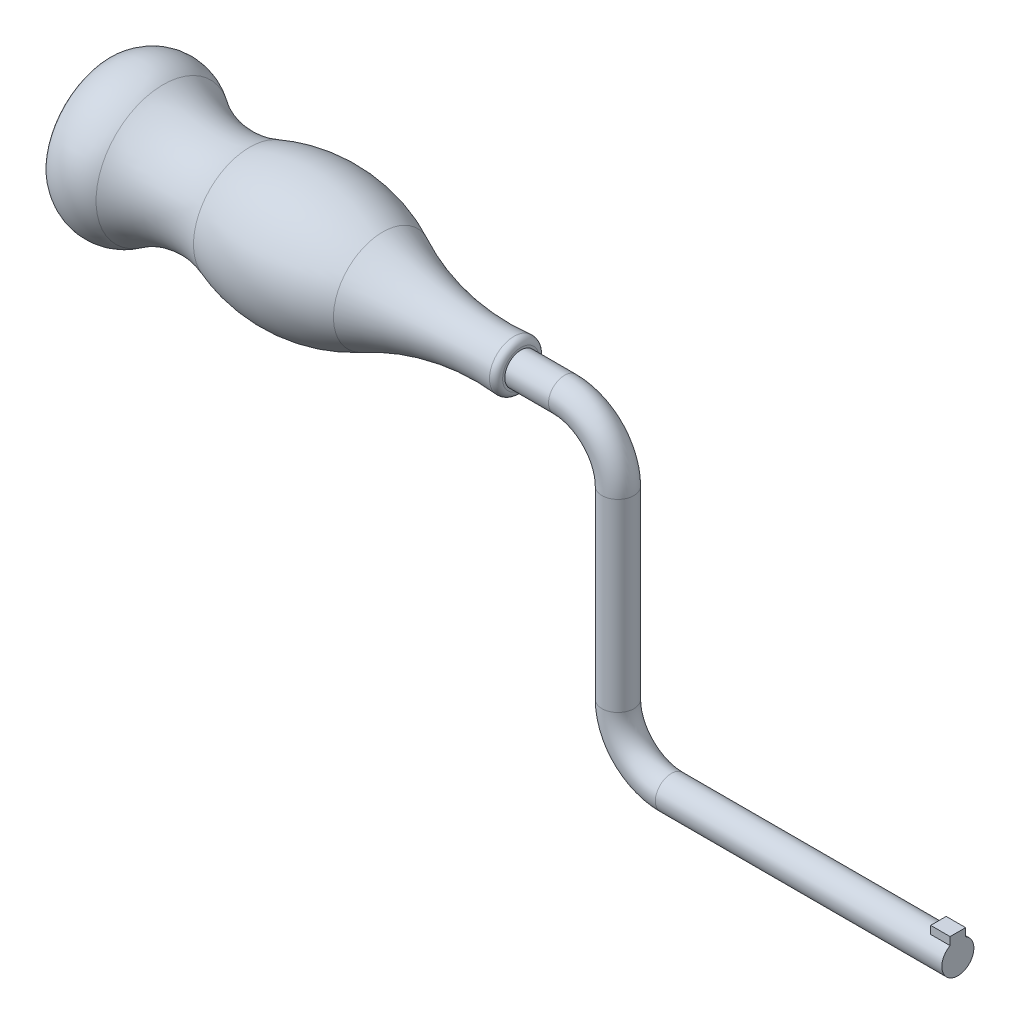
ISO-10303-21;
HEADER;
FILE_DESCRIPTION(('STEP AP214'),'2;1');
FILE_NAME('part.step','',(''),(''),'','','');
FILE_SCHEMA(('AUTOMOTIVE_DESIGN { 1 0 10303 214 1 1 1 1 }'));
ENDSEC;
DATA;
#1=APPLICATION_CONTEXT('core data for automotive mechanical design processes');
#2=APPLICATION_PROTOCOL_DEFINITION('international standard','automotive_design',2000,#1);
#3=PRODUCT_CONTEXT('',#1,'mechanical');
#4=PRODUCT('Part','Part','',(#3));
#5=PRODUCT_RELATED_PRODUCT_CATEGORY('part','',(#4));
#6=PRODUCT_DEFINITION_FORMATION('','',#4);
#7=PRODUCT_DEFINITION_CONTEXT('part definition',#1,'design');
#8=PRODUCT_DEFINITION('design','',#6,#7);
#9=PRODUCT_DEFINITION_SHAPE('','',#8);
#10=(LENGTH_UNIT() NAMED_UNIT(*) SI_UNIT(.MILLI.,.METRE.));
#11=(NAMED_UNIT(*) PLANE_ANGLE_UNIT() SI_UNIT($,.RADIAN.));
#12=(NAMED_UNIT(*) SI_UNIT($,.STERADIAN.) SOLID_ANGLE_UNIT());
#13=UNCERTAINTY_MEASURE_WITH_UNIT(LENGTH_MEASURE(1.E-05),#10,'distance_accuracy_value','');
#14=(GEOMETRIC_REPRESENTATION_CONTEXT(3) GLOBAL_UNCERTAINTY_ASSIGNED_CONTEXT((#13)) GLOBAL_UNIT_ASSIGNED_CONTEXT((#10,
#11,#12)) REPRESENTATION_CONTEXT('',''));
#15=CARTESIAN_POINT('',(0.,0.,0.));
#16=DIRECTION('',(0.,0.,1.));
#17=DIRECTION('',(1.,0.,0.));
#18=AXIS2_PLACEMENT_3D('',#15,#16,#17);
#19=CARTESIAN_POINT('',(-24.13,313.435579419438,0.));
#20=DIRECTION('',(1.,0.,0.));
#21=DIRECTION('',(0.,1.,0.));
#22=AXIS2_PLACEMENT_3D('',#19,#20,#21);
#23=CYLINDRICAL_SURFACE('',#22,2.0955);
#24=CARTESIAN_POINT('',(-24.13,313.435579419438,0.));
#25=DIRECTION('',(-1.,0.,0.));
#26=DIRECTION('',(0.,0.,1.));
#27=AXIS2_PLACEMENT_3D('',#24,#25,#26);
#28=CIRCLE('',#27,2.0955);
#29=CARTESIAN_POINT('',(-24.13,311.340079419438,0.));
#30=VERTEX_POINT('',#29);
#31=EDGE_CURVE('E117',#30,#30,#28,.T.);
#32=ORIENTED_EDGE('',*,*,#31,.F.);
#33=EDGE_LOOP('',(#32));
#34=FACE_BOUND('',#33,.T.);
#35=CARTESIAN_POINT('',(13.335,313.435579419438,0.));
#36=DIRECTION('',(-1.,0.,0.));
#37=DIRECTION('',(0.,0.,1.));
#38=AXIS2_PLACEMENT_3D('',#35,#36,#37);
#39=CIRCLE('',#38,2.0955);
#40=CARTESIAN_POINT('',(13.335,315.268299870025,-1.016));
#41=VERTEX_POINT('',#40);
#42=CARTESIAN_POINT('',(13.335,315.268299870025,1.016));
#43=VERTEX_POINT('',#42);
#44=EDGE_CURVE('E38',#41,#43,#39,.T.);
#45=ORIENTED_EDGE('',*,*,#44,.T.);
#46=DIRECTION('',(1.,0.,0.));
#47=VECTOR('',#46,1.);
#48=CARTESIAN_POINT('',(-24.13,315.268299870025,1.016));
#49=LINE('',#48,#47);
#50=CARTESIAN_POINT('',(10.795,315.268299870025,1.016));
#51=VERTEX_POINT('',#50);
#52=EDGE_CURVE('E45',#43,#51,#49,.F.);
#53=ORIENTED_EDGE('',*,*,#52,.T.);
#54=CARTESIAN_POINT('',(10.795,313.435579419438,0.));
#55=DIRECTION('',(1.,0.,0.));
#56=DIRECTION('',(0.,0.,-1.));
#57=AXIS2_PLACEMENT_3D('',#54,#55,#56);
#58=CIRCLE('',#57,2.0955);
#59=CARTESIAN_POINT('',(10.795,315.268299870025,-1.016));
#60=VERTEX_POINT('',#59);
#61=EDGE_CURVE('E11',#60,#51,#58,.T.);
#62=ORIENTED_EDGE('',*,*,#61,.F.);
#63=DIRECTION('',(1.,0.,0.));
#64=VECTOR('',#63,1.);
#65=CARTESIAN_POINT('',(-24.13,315.268299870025,-1.016));
#66=LINE('',#65,#64);
#67=EDGE_CURVE('E49',#41,#60,#66,.F.);
#68=ORIENTED_EDGE('',*,*,#67,.F.);
#69=EDGE_LOOP('',(#45,#53,#62,#68));
#70=FACE_BOUND('',#69,.T.);
#71=ADVANCED_FACE('F31',(#34,#70),#23,.T.);
#72=CARTESIAN_POINT('',(-24.13,320.420579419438,0.));
#73=DIRECTION('',(0.,0.,1.));
#74=DIRECTION('',(1.,0.,0.));
#75=AXIS2_PLACEMENT_3D('',#72,#73,#74);
#76=TOROIDAL_SURFACE('',#75,6.98499999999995,2.0955);
#77=CARTESIAN_POINT('',(-31.115,320.420579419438,0.));
#78=DIRECTION('',(0.,1.,0.));
#79=DIRECTION('',(0.,0.,1.));
#80=AXIS2_PLACEMENT_3D('',#77,#78,#79);
#81=CIRCLE('',#80,2.0955);
#82=CARTESIAN_POINT('',(-33.2105,320.420579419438,0.));
#83=VERTEX_POINT('',#82);
#84=EDGE_CURVE('E114',#83,#83,#81,.T.);
#85=CARTESIAN_POINT('',(-24.13,320.420579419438,0.));
#86=DIRECTION('',(0.,0.,1.));
#87=DIRECTION('',(1.,0.,0.));
#88=AXIS2_PLACEMENT_3D('',#85,#86,#87);
#89=CIRCLE('',#88,9.08049999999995);
#90=EDGE_CURVE('',#83,#30,#89,.T.);
#91=ORIENTED_EDGE('',*,*,#84,.F.);
#92=ORIENTED_EDGE('',*,*,#31,.T.);
#93=ORIENTED_EDGE('',*,*,#90,.T.);
#94=ORIENTED_EDGE('',*,*,#90,.F.);
#95=EDGE_LOOP('',(#91,#93,#92,#94));
#96=FACE_BOUND('',#95,.T.);
#97=ADVANCED_FACE('F135',(#96),#76,.T.);
#98=CARTESIAN_POINT('',(-31.115,344.550579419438,0.));
#99=DIRECTION('',(0.,-1.,0.));
#100=DIRECTION('',(1.,0.,0.));
#101=AXIS2_PLACEMENT_3D('',#98,#99,#100);
#102=CYLINDRICAL_SURFACE('',#101,2.0955);
#103=CARTESIAN_POINT('',(-31.115,344.550579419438,0.));
#104=DIRECTION('',(0.,1.,0.));
#105=DIRECTION('',(0.,0.,1.));
#106=AXIS2_PLACEMENT_3D('',#103,#104,#105);
#107=CIRCLE('',#106,2.0955);
#108=CARTESIAN_POINT('',(-29.0195,344.550579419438,0.));
#109=VERTEX_POINT('',#108);
#110=EDGE_CURVE('E109',#109,#109,#107,.T.);
#111=ORIENTED_EDGE('',*,*,#110,.F.);
#112=EDGE_LOOP('',(#111));
#113=FACE_BOUND('',#112,.T.);
#114=ORIENTED_EDGE('',*,*,#84,.T.);
#115=EDGE_LOOP('',(#114));
#116=FACE_BOUND('',#115,.T.);
#117=ADVANCED_FACE('F140',(#113,#116),#102,.T.);
#118=CARTESIAN_POINT('',(-38.1,344.550579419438,0.));
#119=DIRECTION('',(0.,0.,-1.));
#120=DIRECTION('',(-1.,0.,0.));
#121=AXIS2_PLACEMENT_3D('',#118,#119,#120);
#122=TOROIDAL_SURFACE('',#121,6.98500000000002,2.0955);
#123=CARTESIAN_POINT('',(-38.1,351.535579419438,0.));
#124=DIRECTION('',(-1.,0.,0.));
#125=DIRECTION('',(0.,0.,1.));
#126=AXIS2_PLACEMENT_3D('',#123,#124,#125);
#127=CIRCLE('',#126,2.0955);
#128=CARTESIAN_POINT('',(-38.1,353.631079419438,0.));
#129=VERTEX_POINT('',#128);
#130=EDGE_CURVE('E106',#129,#129,#127,.T.);
#131=CARTESIAN_POINT('',(-38.1,344.550579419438,0.));
#132=DIRECTION('',(0.,0.,-1.));
#133=DIRECTION('',(-1.,0.,0.));
#134=AXIS2_PLACEMENT_3D('',#131,#132,#133);
#135=CIRCLE('',#134,9.08050000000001);
#136=EDGE_CURVE('',#129,#109,#135,.T.);
#137=ORIENTED_EDGE('',*,*,#130,.F.);
#138=ORIENTED_EDGE('',*,*,#110,.T.);
#139=ORIENTED_EDGE('',*,*,#136,.T.);
#140=ORIENTED_EDGE('',*,*,#136,.F.);
#141=EDGE_LOOP('',(#137,#139,#138,#140));
#142=FACE_BOUND('',#141,.T.);
#143=ADVANCED_FACE('F147',(#142),#122,.T.);
#144=CARTESIAN_POINT('',(-38.1,351.535579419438,0.));
#145=DIRECTION('',(-1.,0.,0.));
#146=DIRECTION('',(0.,-1.,0.));
#147=AXIS2_PLACEMENT_3D('',#144,#145,#146);
#148=CYLINDRICAL_SURFACE('',#147,2.0955);
#149=ORIENTED_EDGE('',*,*,#130,.T.);
#150=EDGE_LOOP('',(#149));
#151=FACE_BOUND('',#150,.T.);
#152=CARTESIAN_POINT('',(-43.815,351.535579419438,0.));
#153=DIRECTION('',(-1.,0.,0.));
#154=DIRECTION('',(0.,0.,1.));
#155=AXIS2_PLACEMENT_3D('',#152,#153,#154);
#156=CIRCLE('',#155,2.0955);
#157=CARTESIAN_POINT('',(-43.815,351.535579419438,2.0955));
#158=VERTEX_POINT('',#157);
#159=EDGE_CURVE('E105',#158,#158,#156,.T.);
#160=ORIENTED_EDGE('',*,*,#159,.F.);
#161=EDGE_LOOP('',(#160));
#162=FACE_BOUND('',#161,.T.);
#163=ADVANCED_FACE('F130',(#151,#162),#148,.T.);
#164=CARTESIAN_POINT('',(13.335,313.435579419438,0.));
#165=DIRECTION('',(-1.,0.,0.));
#166=DIRECTION('',(0.,0.,1.));
#167=AXIS2_PLACEMENT_3D('',#164,#165,#166);
#168=PLANE('',#167);
#169=ORIENTED_EDGE('',*,*,#44,.F.);
#170=DIRECTION('',(0.,1.,0.));
#171=VECTOR('',#170,1.);
#172=CARTESIAN_POINT('',(13.335,315.531079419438,-1.016));
#173=LINE('',#172,#171);
#174=CARTESIAN_POINT('',(13.335,316.293079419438,-1.016));
#175=VERTEX_POINT('',#174);
#176=EDGE_CURVE('E82',#41,#175,#173,.T.);
#177=ORIENTED_EDGE('',*,*,#176,.T.);
#178=DIRECTION('',(0.,0.,-1.));
#179=VECTOR('',#178,1.);
#180=CARTESIAN_POINT('',(13.335,316.293079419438,1.016));
#181=LINE('',#180,#179);
#182=CARTESIAN_POINT('',(13.335,316.293079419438,1.016));
#183=VERTEX_POINT('',#182);
#184=EDGE_CURVE('E79',#183,#175,#181,.T.);
#185=ORIENTED_EDGE('',*,*,#184,.F.);
#186=DIRECTION('',(0.,1.,0.));
#187=VECTOR('',#186,1.);
#188=CARTESIAN_POINT('',(13.335,315.150079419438,1.016));
#189=LINE('',#188,#187);
#190=EDGE_CURVE('E68',#43,#183,#189,.T.);
#191=ORIENTED_EDGE('',*,*,#190,.F.);
#192=EDGE_LOOP('',(#169,#177,#185,#191));
#193=FACE_BOUND('',#192,.T.);
#194=ADVANCED_FACE('F80',(#193),#168,.F.);
#195=CARTESIAN_POINT('',(10.795,315.531079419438,1.016));
#196=DIRECTION('',(1.,0.,0.));
#197=DIRECTION('',(0.,0.,-1.));
#198=AXIS2_PLACEMENT_3D('',#195,#196,#197);
#199=PLANE('',#198);
#200=DIRECTION('',(0.,-1.,0.));
#201=VECTOR('',#200,1.);
#202=CARTESIAN_POINT('',(10.795,315.531079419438,-1.016));
#203=LINE('',#202,#201);
#204=CARTESIAN_POINT('',(10.795,316.293079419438,-1.016));
#205=VERTEX_POINT('',#204);
#206=EDGE_CURVE('E76',#205,#60,#203,.T.);
#207=ORIENTED_EDGE('',*,*,#206,.T.);
#208=ORIENTED_EDGE('',*,*,#61,.T.);
#209=DIRECTION('',(0.,-1.,0.));
#210=VECTOR('',#209,1.);
#211=CARTESIAN_POINT('',(10.795,316.293079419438,1.016));
#212=LINE('',#211,#210);
#213=CARTESIAN_POINT('',(10.795,316.293079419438,1.016));
#214=VERTEX_POINT('',#213);
#215=EDGE_CURVE('E91',#214,#51,#212,.T.);
#216=ORIENTED_EDGE('',*,*,#215,.F.);
#217=DIRECTION('',(0.,0.,-1.));
#218=VECTOR('',#217,1.);
#219=CARTESIAN_POINT('',(10.795,316.293079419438,1.016));
#220=LINE('',#219,#218);
#221=EDGE_CURVE('E86',#214,#205,#220,.T.);
#222=ORIENTED_EDGE('',*,*,#221,.T.);
#223=EDGE_LOOP('',(#207,#208,#216,#222));
#224=FACE_BOUND('',#223,.T.);
#225=ADVANCED_FACE('F122',(#224),#199,.F.);
#226=CARTESIAN_POINT('',(13.335,316.293079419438,1.016));
#227=DIRECTION('',(0.,0.,1.));
#228=DIRECTION('',(1.,0.,0.));
#229=AXIS2_PLACEMENT_3D('',#226,#227,#228);
#230=PLANE('',#229);
#231=ORIENTED_EDGE('',*,*,#52,.F.);
#232=ORIENTED_EDGE('',*,*,#190,.T.);
#233=DIRECTION('',(-1.,0.,0.));
#234=VECTOR('',#233,1.);
#235=CARTESIAN_POINT('',(13.335,316.293079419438,1.016));
#236=LINE('',#235,#234);
#237=EDGE_CURVE('E73',#183,#214,#236,.T.);
#238=ORIENTED_EDGE('',*,*,#237,.T.);
#239=ORIENTED_EDGE('',*,*,#215,.T.);
#240=EDGE_LOOP('',(#231,#232,#238,#239));
#241=FACE_BOUND('',#240,.T.);
#242=ADVANCED_FACE('F70',(#241),#230,.T.);
#243=CARTESIAN_POINT('',(13.335,316.293079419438,-1.016));
#244=DIRECTION('',(0.,0.,1.));
#245=DIRECTION('',(1.,0.,0.));
#246=AXIS2_PLACEMENT_3D('',#243,#244,#245);
#247=PLANE('',#246);
#248=ORIENTED_EDGE('',*,*,#176,.F.);
#249=ORIENTED_EDGE('',*,*,#67,.T.);
#250=ORIENTED_EDGE('',*,*,#206,.F.);
#251=DIRECTION('',(-1.,0.,0.));
#252=VECTOR('',#251,1.);
#253=CARTESIAN_POINT('',(13.335,316.293079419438,-1.016));
#254=LINE('',#253,#252);
#255=EDGE_CURVE('E97',#175,#205,#254,.T.);
#256=ORIENTED_EDGE('',*,*,#255,.F.);
#257=EDGE_LOOP('',(#248,#249,#250,#256));
#258=FACE_BOUND('',#257,.T.);
#259=ADVANCED_FACE('F120',(#258),#247,.F.);
#260=CARTESIAN_POINT('',(13.335,316.293079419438,1.016));
#261=DIRECTION('',(0.,-1.,0.));
#262=DIRECTION('',(0.,0.,-1.));
#263=AXIS2_PLACEMENT_3D('',#260,#261,#262);
#264=PLANE('',#263);
#265=ORIENTED_EDGE('',*,*,#255,.T.);
#266=ORIENTED_EDGE('',*,*,#221,.F.);
#267=ORIENTED_EDGE('',*,*,#237,.F.);
#268=ORIENTED_EDGE('',*,*,#184,.T.);
#269=EDGE_LOOP('',(#265,#266,#267,#268));
#270=FACE_BOUND('',#269,.T.);
#271=ADVANCED_FACE('F88',(#270),#264,.F.);
#272=CARTESIAN_POINT('',(-43.815,351.535579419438,0.));
#273=DIRECTION('',(1.,0.,0.));
#274=DIRECTION('',(0.,0.,-1.));
#275=AXIS2_PLACEMENT_3D('',#272,#273,#274);
#276=PLANE('',#275);
#277=ORIENTED_EDGE('',*,*,#159,.T.);
#278=EDGE_LOOP('',(#277));
#279=FACE_BOUND('',#278,.T.);
#280=CARTESIAN_POINT('',(-43.815,351.535579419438,0.));
#281=DIRECTION('',(1.,0.,0.));
#282=DIRECTION('',(0.,0.,-1.));
#283=AXIS2_PLACEMENT_3D('',#280,#281,#282);
#284=CIRCLE('',#283,2.38063889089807);
#285=CARTESIAN_POINT('',(-43.815,351.535579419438,-2.38063889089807));
#286=VERTEX_POINT('',#285);
#287=EDGE_CURVE('E98',#286,#286,#284,.T.);
#288=ORIENTED_EDGE('',*,*,#287,.T.);
#289=EDGE_LOOP('',(#288));
#290=FACE_BOUND('',#289,.T.);
#291=ADVANCED_FACE('F158',(#279,#290),#276,.T.);
#292=CARTESIAN_POINT('',(-44.6405,351.535579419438,0.));
#293=DIRECTION('',(1.,0.,0.));
#294=DIRECTION('',(0.,0.,-1.));
#295=AXIS2_PLACEMENT_3D('',#292,#293,#294);
#296=TOROIDAL_SURFACE('',#295,2.38063889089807,0.825500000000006);
#297=CARTESIAN_POINT('',(-44.7116593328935,351.535579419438,0.));
#298=DIRECTION('',(1.,0.,0.));
#299=DIRECTION('',(0.,0.,-1.));
#300=AXIS2_PLACEMENT_3D('',#297,#298,#299);
#301=CIRCLE('',#300,3.20306615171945);
#302=CARTESIAN_POINT('',(-44.7116593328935,351.535579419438,-3.20306615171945));
#303=VERTEX_POINT('',#302);
#304=EDGE_CURVE('E214',#303,#303,#301,.T.);
#305=ORIENTED_EDGE('',*,*,#304,.T.);
#306=EDGE_LOOP('',(#305));
#307=FACE_BOUND('',#306,.T.);
#308=ORIENTED_EDGE('',*,*,#287,.F.);
#309=EDGE_LOOP('',(#308));
#310=FACE_BOUND('',#309,.T.);
#311=ADVANCED_FACE('F163',(#307,#310),#296,.T.);
#312=CARTESIAN_POINT('',(-47.507349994,351.535579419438,0.));
#313=DIRECTION('',(1.,0.,0.));
#314=DIRECTION('',(0.,0.,-1.));
#315=AXIS2_PLACEMENT_3D('',#312,#313,#314);
#316=TOROIDAL_SURFACE('',#315,35.514389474,32.432044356);
#317=CARTESIAN_POINT('',(-61.8800813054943,351.535579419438,0.));
#318=DIRECTION('',(1.,0.,0.));
#319=DIRECTION('',(0.,0.,-1.));
#320=AXIS2_PLACEMENT_3D('',#317,#318,#319);
#321=CIRCLE('',#320,6.44099793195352);
#322=CARTESIAN_POINT('',(-61.8800813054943,351.535579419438,-6.44099793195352));
#323=VERTEX_POINT('',#322);
#324=EDGE_CURVE('E211',#323,#323,#321,.T.);
#325=ORIENTED_EDGE('',*,*,#324,.T.);
#326=EDGE_LOOP('',(#325));
#327=FACE_BOUND('',#326,.T.);
#328=ORIENTED_EDGE('',*,*,#304,.F.);
#329=EDGE_LOOP('',(#328));
#330=FACE_BOUND('',#329,.T.);
#331=ADVANCED_FACE('F171',(#327,#330),#316,.F.);
#332=CARTESIAN_POINT('',(-71.62972974,351.535579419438,0.));
#333=DIRECTION('',(1.,0.,0.));
#334=DIRECTION('',(0.,0.,-1.));
#335=AXIS2_PLACEMENT_3D('',#332,#333,#334);
#336=DEGENERATE_TOROIDAL_SURFACE('',#335,13.2807473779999,22.0000655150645,.F.);
#337=CARTESIAN_POINT('',(-79.2690744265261,351.535579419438,0.));
#338=DIRECTION('',(1.,0.,0.));
#339=DIRECTION('',(0.,0.,-1.));
#340=AXIS2_PLACEMENT_3D('',#337,#338,#339);
#341=CIRCLE('',#340,7.35037705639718);
#342=CARTESIAN_POINT('',(-79.2690744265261,351.535579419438,-7.35037705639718));
#343=VERTEX_POINT('',#342);
#344=EDGE_CURVE('E208',#343,#343,#341,.T.);
#345=ORIENTED_EDGE('',*,*,#344,.T.);
#346=EDGE_LOOP('',(#345));
#347=FACE_BOUND('',#346,.T.);
#348=ORIENTED_EDGE('',*,*,#324,.F.);
#349=EDGE_LOOP('',(#348));
#350=FACE_BOUND('',#349,.T.);
#351=ADVANCED_FACE('F175',(#347,#350),#336,.F.);
#352=CARTESIAN_POINT('',(-83.554287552,351.535579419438,0.));
#353=DIRECTION('',(1.,0.,0.));
#354=DIRECTION('',(0.,0.,-1.));
#355=AXIS2_PLACEMENT_3D('',#352,#353,#354);
#356=TOROIDAL_SURFACE('',#355,18.9231976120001,12.3407142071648);
#357=CARTESIAN_POINT('',(-90.5832445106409,351.535579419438,0.));
#358=DIRECTION('',(1.,0.,0.));
#359=DIRECTION('',(0.,0.,-1.));
#360=AXIS2_PLACEMENT_3D('',#357,#358,#359);
#361=CIRCLE('',#360,8.77987511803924);
#362=CARTESIAN_POINT('',(-90.5832445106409,351.535579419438,-8.77987511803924));
#363=VERTEX_POINT('',#362);
#364=EDGE_CURVE('E203',#363,#363,#361,.T.);
#365=ORIENTED_EDGE('',*,*,#364,.T.);
#366=EDGE_LOOP('',(#365));
#367=FACE_BOUND('',#366,.T.);
#368=ORIENTED_EDGE('',*,*,#344,.F.);
#369=EDGE_LOOP('',(#368));
#370=FACE_BOUND('',#369,.T.);
#371=ADVANCED_FACE('F179',(#367,#370),#356,.F.);
#372=CARTESIAN_POINT('',(-93.8110440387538,351.535579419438,0.));
#373=DIRECTION('',(1.,0.,0.));
#374=DIRECTION('',(0.,0.,-1.));
#375=AXIS2_PLACEMENT_3D('',#372,#373,#374);
#376=DEGENERATE_TOROIDAL_SURFACE('',#375,4.12191352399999,5.66703591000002,.T.);
#377=CARTESIAN_POINT('',(-97.3694928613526,351.535579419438,0.));
#378=DIRECTION('',(1.,0.,0.));
#379=DIRECTION('',(0.,0.,-1.));
#380=AXIS2_PLACEMENT_3D('',#377,#378,#379);
#381=CIRCLE('',#380,8.53243934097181);
#382=CARTESIAN_POINT('',(-97.3694928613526,351.535579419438,-8.53243934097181));
#383=VERTEX_POINT('',#382);
#384=EDGE_CURVE('E200',#383,#383,#381,.T.);
#385=ORIENTED_EDGE('',*,*,#384,.T.);
#386=EDGE_LOOP('',(#385));
#387=FACE_BOUND('',#386,.T.);
#388=ORIENTED_EDGE('',*,*,#364,.F.);
#389=EDGE_LOOP('',(#388));
#390=FACE_BOUND('',#389,.T.);
#391=ADVANCED_FACE('F183',(#387,#390),#376,.T.);
#392=CARTESIAN_POINT('',(-96.851144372,351.535579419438,0.));
#393=DIRECTION('',(1.,0.,0.));
#394=DIRECTION('',(0.,0.,-1.));
#395=AXIS2_PLACEMENT_3D('',#392,#393,#394);
#396=TOROIDAL_SURFACE('',#395,7.88997137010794,0.825499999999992);
#397=CARTESIAN_POINT('',(-97.676644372,351.535579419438,0.));
#398=DIRECTION('',(1.,0.,0.));
#399=DIRECTION('',(0.,0.,-1.));
#400=AXIS2_PLACEMENT_3D('',#397,#398,#399);
#401=CIRCLE('',#400,7.88997137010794);
#402=CARTESIAN_POINT('',(-97.676644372,351.535579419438,-7.88997137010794));
#403=VERTEX_POINT('',#402);
#404=EDGE_CURVE('E199',#403,#403,#401,.T.);
#405=ORIENTED_EDGE('',*,*,#404,.T.);
#406=EDGE_LOOP('',(#405));
#407=FACE_BOUND('',#406,.T.);
#408=ORIENTED_EDGE('',*,*,#384,.F.);
#409=EDGE_LOOP('',(#408));
#410=FACE_BOUND('',#409,.T.);
#411=ADVANCED_FACE('F187',(#407,#410),#396,.T.);
#412=CARTESIAN_POINT('',(-97.676644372,359.425550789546,0.));
#413=DIRECTION('',(-1.,0.,0.));
#414=DIRECTION('',(0.,0.,1.));
#415=AXIS2_PLACEMENT_3D('',#412,#413,#414);
#416=PLANE('',#415);
#417=ORIENTED_EDGE('',*,*,#404,.F.);
#418=EDGE_LOOP('',(#417));
#419=FACE_BOUND('',#418,.T.);
#420=ADVANCED_FACE('F191',(#419),#416,.T.);
#421=CLOSED_SHELL('',(#71,#97,#117,#143,#163,#194,#225,#242,#259,#271,#291,#311,#331,#351,#371,
#391,#411,#420));
#422=MANIFOLD_SOLID_BREP('B2',#421);
#423=ADVANCED_BREP_SHAPE_REPRESENTATION('',(#18,#422),#14);
#424=SHAPE_DEFINITION_REPRESENTATION(#9,#423);
ENDSEC;
END-ISO-10303-21;
